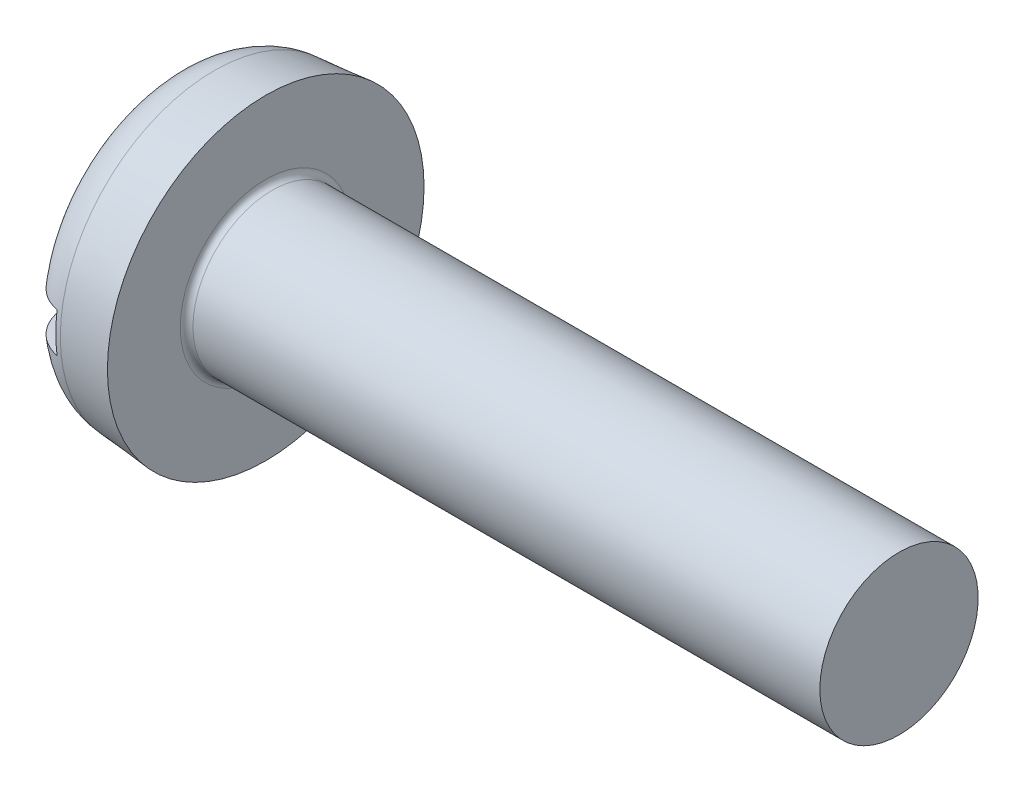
ISO-10303-21;
HEADER;
FILE_DESCRIPTION(('STEP AP214'),'2;1');
FILE_NAME('part.step','',(''),(''),'','','');
FILE_SCHEMA(('AUTOMOTIVE_DESIGN { 1 0 10303 214 1 1 1 1 }'));
ENDSEC;
DATA;
#1=APPLICATION_CONTEXT('core data for automotive mechanical design processes');
#2=APPLICATION_PROTOCOL_DEFINITION('international standard','automotive_design',2000,#1);
#3=PRODUCT_CONTEXT('',#1,'mechanical');
#4=PRODUCT('Part','Part','',(#3));
#5=PRODUCT_RELATED_PRODUCT_CATEGORY('part','',(#4));
#6=PRODUCT_DEFINITION_FORMATION('','',#4);
#7=PRODUCT_DEFINITION_CONTEXT('part definition',#1,'design');
#8=PRODUCT_DEFINITION('design','',#6,#7);
#9=PRODUCT_DEFINITION_SHAPE('','',#8);
#10=(LENGTH_UNIT() NAMED_UNIT(*) SI_UNIT(.MILLI.,.METRE.));
#11=(NAMED_UNIT(*) PLANE_ANGLE_UNIT() SI_UNIT($,.RADIAN.));
#12=(NAMED_UNIT(*) SI_UNIT($,.STERADIAN.) SOLID_ANGLE_UNIT());
#13=UNCERTAINTY_MEASURE_WITH_UNIT(LENGTH_MEASURE(1.E-05),#10,'distance_accuracy_value','');
#14=(GEOMETRIC_REPRESENTATION_CONTEXT(3) GLOBAL_UNCERTAINTY_ASSIGNED_CONTEXT((#13)) GLOBAL_UNIT_ASSIGNED_CONTEXT((#10,
#11,#12)) REPRESENTATION_CONTEXT('',''));
#15=CARTESIAN_POINT('',(0.,0.,0.));
#16=DIRECTION('',(0.,0.,1.));
#17=DIRECTION('',(1.,0.,0.));
#18=AXIS2_PLACEMENT_3D('',#15,#16,#17);
#19=CARTESIAN_POINT('',(0.,0.,0.));
#20=DIRECTION('',(1.,0.,0.));
#21=DIRECTION('',(0.,0.,-1.));
#22=AXIS2_PLACEMENT_3D('',#19,#20,#21);
#23=PLANE('',#22);
#24=CARTESIAN_POINT('',(0.,0.,0.));
#25=DIRECTION('',(1.,0.,0.));
#26=DIRECTION('',(0.,0.,-1.));
#27=AXIS2_PLACEMENT_3D('',#24,#25,#26);
#28=CIRCLE('',#27,6.72607449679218);
#29=CARTESIAN_POINT('',(0.,1.25,6.60890143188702));
#30=VERTEX_POINT('',#29);
#31=CARTESIAN_POINT('',(0.,1.25,-6.60890143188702));
#32=VERTEX_POINT('',#31);
#33=EDGE_CURVE('E100',#30,#32,#28,.F.);
#34=ORIENTED_EDGE('',*,*,#33,.T.);
#35=DIRECTION('',(0.,0.,-1.));
#36=VECTOR('',#35,1.);
#37=CARTESIAN_POINT('',(0.,1.25,-10.));
#38=LINE('',#37,#36);
#39=EDGE_CURVE('E93',#30,#32,#38,.T.);
#40=ORIENTED_EDGE('',*,*,#39,.F.);
#41=EDGE_LOOP('',(#34,#40));
#42=FACE_BOUND('',#41,.T.);
#43=ADVANCED_FACE('F39',(#42),#23,.F.);
#44=CARTESIAN_POINT('',(0.,-1.25,-6.60890143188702));
#45=VERTEX_POINT('',#44);
#46=CARTESIAN_POINT('',(0.,-1.25,6.60890143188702));
#47=VERTEX_POINT('',#46);
#48=EDGE_CURVE('E89',#45,#47,#28,.F.);
#49=ORIENTED_EDGE('',*,*,#48,.T.);
#50=DIRECTION('',(0.,0.,1.));
#51=VECTOR('',#50,1.);
#52=CARTESIAN_POINT('',(0.,-1.25,-10.));
#53=LINE('',#52,#51);
#54=EDGE_CURVE('E81',#45,#47,#53,.T.);
#55=ORIENTED_EDGE('',*,*,#54,.F.);
#56=EDGE_LOOP('',(#49,#55));
#57=FACE_BOUND('',#56,.T.);
#58=ADVANCED_FACE('F87',(#57),#23,.F.);
#59=CARTESIAN_POINT('',(6.,0.,0.));
#60=DIRECTION('',(1.,0.,0.));
#61=DIRECTION('',(0.,0.,-1.));
#62=AXIS2_PLACEMENT_3D('',#59,#60,#61);
#63=CONICAL_SURFACE('',#62,10.,0.0872664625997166);
#64=CARTESIAN_POINT('',(2.73853277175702,0.,0.));
#65=DIRECTION('',(-1.,0.,0.));
#66=DIRECTION('',(0.,0.,1.));
#67=AXIS2_PLACEMENT_3D('',#64,#65,#66);
#68=CIRCLE('',#67,9.71465859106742);
#69=CARTESIAN_POINT('',(2.73853277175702,0.,9.71465859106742));
#70=VERTEX_POINT('',#69);
#71=EDGE_CURVE('E96',#70,#70,#68,.F.);
#72=ORIENTED_EDGE('',*,*,#71,.T.);
#73=EDGE_LOOP('',(#72));
#74=FACE_BOUND('',#73,.T.);
#75=CARTESIAN_POINT('',(6.,0.,0.));
#76=DIRECTION('',(-1.,0.,0.));
#77=DIRECTION('',(0.,0.,1.));
#78=AXIS2_PLACEMENT_3D('',#75,#76,#77);
#79=CIRCLE('',#78,10.);
#80=CARTESIAN_POINT('',(6.,0.,10.));
#81=VERTEX_POINT('',#80);
#82=EDGE_CURVE('E102',#81,#81,#79,.T.);
#83=ORIENTED_EDGE('',*,*,#82,.T.);
#84=EDGE_LOOP('',(#83));
#85=FACE_BOUND('',#84,.T.);
#86=ADVANCED_FACE('F149',(#74,#85),#63,.T.);
#87=CARTESIAN_POINT('',(6.,10.,0.));
#88=DIRECTION('',(-1.,0.,0.));
#89=DIRECTION('',(0.,0.,1.));
#90=AXIS2_PLACEMENT_3D('',#87,#88,#89);
#91=PLANE('',#90);
#92=CARTESIAN_POINT('',(6.,0.,0.));
#93=DIRECTION('',(-1.,0.,0.));
#94=DIRECTION('',(0.,0.,1.));
#95=AXIS2_PLACEMENT_3D('',#92,#93,#94);
#96=CIRCLE('',#95,5.4);
#97=CARTESIAN_POINT('',(6.,0.,5.4));
#98=VERTEX_POINT('',#97);
#99=EDGE_CURVE('E105',#98,#98,#96,.T.);
#100=ORIENTED_EDGE('',*,*,#99,.T.);
#101=EDGE_LOOP('',(#100));
#102=FACE_BOUND('',#101,.T.);
#103=ORIENTED_EDGE('',*,*,#82,.F.);
#104=EDGE_LOOP('',(#103));
#105=FACE_BOUND('',#104,.T.);
#106=ADVANCED_FACE('F143',(#102,#105),#91,.F.);
#107=CARTESIAN_POINT('',(0.,0.,0.));
#108=DIRECTION('',(-1.,0.,0.));
#109=DIRECTION('',(0.,0.,1.));
#110=AXIS2_PLACEMENT_3D('',#107,#108,#109);
#111=CYLINDRICAL_SURFACE('',#110,5.);
#112=CARTESIAN_POINT('',(6.4,0.,0.));
#113=DIRECTION('',(-1.,0.,0.));
#114=DIRECTION('',(0.,0.,1.));
#115=AXIS2_PLACEMENT_3D('',#112,#113,#114);
#116=CIRCLE('',#115,5.);
#117=CARTESIAN_POINT('',(6.4,0.,5.));
#118=VERTEX_POINT('',#117);
#119=EDGE_CURVE('E111',#118,#118,#116,.F.);
#120=ORIENTED_EDGE('',*,*,#119,.T.);
#121=EDGE_LOOP('',(#120));
#122=FACE_BOUND('',#121,.T.);
#123=CARTESIAN_POINT('',(46.,0.,0.));
#124=DIRECTION('',(-1.,0.,0.));
#125=DIRECTION('',(0.,0.,1.));
#126=AXIS2_PLACEMENT_3D('',#123,#124,#125);
#127=CIRCLE('',#126,5.);
#128=CARTESIAN_POINT('',(46.,0.,5.));
#129=VERTEX_POINT('',#128);
#130=EDGE_CURVE('E166',#129,#129,#127,.T.);
#131=ORIENTED_EDGE('',*,*,#130,.T.);
#132=EDGE_LOOP('',(#131));
#133=FACE_BOUND('',#132,.T.);
#134=ADVANCED_FACE('F142',(#122,#133),#111,.T.);
#135=CARTESIAN_POINT('',(46.,5.,0.));
#136=DIRECTION('',(-1.,0.,0.));
#137=DIRECTION('',(0.,0.,1.));
#138=AXIS2_PLACEMENT_3D('',#135,#136,#137);
#139=PLANE('',#138);
#140=ORIENTED_EDGE('',*,*,#130,.F.);
#141=EDGE_LOOP('',(#140));
#142=FACE_BOUND('',#141,.T.);
#143=ADVANCED_FACE('F132',(#142),#139,.F.);
#144=CARTESIAN_POINT('',(3.,0.,0.));
#145=DIRECTION('',(1.,0.,0.));
#146=DIRECTION('',(0.,0.,-1.));
#147=AXIS2_PLACEMENT_3D('',#144,#145,#146);
#148=TOROIDAL_SURFACE('',#147,6.72607449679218,3.);
#149=CARTESIAN_POINT('',(1.34081251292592,1.25,-9.14041771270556));
#150=CARTESIAN_POINT('',(1.47997004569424,1.25,-9.23364559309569));
#151=CARTESIAN_POINT('',(1.62706942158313,1.25,-9.31523086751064));
#152=CARTESIAN_POINT('',(1.93299124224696,1.25,-9.45262888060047));
#153=CARTESIAN_POINT('',(2.09182681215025,1.25,-9.50841224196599));
#154=CARTESIAN_POINT('',(2.41658159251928,1.25,-9.59246600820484));
#155=CARTESIAN_POINT('',(2.582498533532,1.25,-9.62074515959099));
#156=CARTESIAN_POINT('',(2.91668270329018,1.25,-9.64897084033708));
#157=CARTESIAN_POINT('',(3.08494936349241,1.25,-9.64892410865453));
#158=CARTESIAN_POINT('',(3.41873792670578,1.25,-9.6205489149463));
#159=CARTESIAN_POINT('',(3.58426467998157,1.25,-9.59227747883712));
#160=CARTESIAN_POINT('',(3.9082324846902,1.25,-9.50836629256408));
#161=CARTESIAN_POINT('',(4.06667331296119,1.25,-9.45272568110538));
#162=CARTESIAN_POINT('',(4.37212351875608,1.25,-9.31564696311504));
#163=CARTESIAN_POINT('',(4.51912348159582,1.25,-9.23418788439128));
#164=CARTESIAN_POINT('',(4.79744436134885,1.25,-9.04785785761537));
#165=CARTESIAN_POINT('',(4.92876507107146,1.25,-8.94298660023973));
#166=CARTESIAN_POINT('',(5.17270515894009,1.25,-8.71230286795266));
#167=CARTESIAN_POINT('',(5.28523171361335,1.25,-8.5863922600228));
#168=CARTESIAN_POINT('',(5.48776799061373,1.25,-8.3176111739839));
#169=CARTESIAN_POINT('',(5.57777697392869,1.25,-8.17474013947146));
#170=CARTESIAN_POINT('',(5.73362485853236,1.25,-7.87474584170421));
#171=CARTESIAN_POINT('',(5.79923985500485,1.25,-7.71750629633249));
#172=CARTESIAN_POINT('',(5.90351740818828,1.25,-7.39433678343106));
#173=CARTESIAN_POINT('',(5.94217838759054,1.25,-7.22840630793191));
#174=CARTESIAN_POINT('',(5.99202504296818,1.25,-6.89024711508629));
#175=CARTESIAN_POINT('',(6.0028436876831,1.25,-6.71796433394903));
#176=CARTESIAN_POINT('',(5.99588219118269,1.25,-6.37398151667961));
#177=CARTESIAN_POINT('',(5.97809968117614,1.25,-6.20228152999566));
#178=CARTESIAN_POINT('',(5.91412563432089,1.25,-5.86143261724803));
#179=CARTESIAN_POINT('',(5.86748736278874,1.25,-5.69236752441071));
#180=CARTESIAN_POINT('',(5.74686216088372,1.25,-5.36428557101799));
#181=CARTESIAN_POINT('',(5.67287236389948,1.25,-5.20526976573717));
#182=CARTESIAN_POINT('',(5.49848893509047,1.25,-4.89968131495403));
#183=CARTESIAN_POINT('',(5.3977652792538,1.25,-4.75329681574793));
#184=CARTESIAN_POINT('',(5.17308325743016,1.25,-4.47955663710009));
#185=CARTESIAN_POINT('',(5.04912274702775,1.25,-4.35220271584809));
#186=CARTESIAN_POINT('',(4.78177797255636,1.25,-4.12101899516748));
#187=CARTESIAN_POINT('',(4.63847541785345,1.25,-4.0170949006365));
#188=CARTESIAN_POINT('',(4.33591165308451,1.25,-3.83586047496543));
#189=CARTESIAN_POINT('',(4.17665481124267,1.25,-3.75854288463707));
#190=CARTESIAN_POINT('',(3.85300941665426,1.25,-3.63615461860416));
#191=CARTESIAN_POINT('',(3.68903889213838,1.25,-3.5899808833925));
#192=CARTESIAN_POINT('',(3.35552430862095,1.25,-3.52750009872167));
#193=CARTESIAN_POINT('',(3.18598268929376,1.25,-3.5111801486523));
#194=CARTESIAN_POINT('',(2.8554004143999,1.25,-3.5092586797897));
#195=CARTESIAN_POINT('',(2.69436660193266,1.25,-3.52213490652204));
#196=CARTESIAN_POINT('',(2.37679746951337,1.25,-3.57489222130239));
#197=CARTESIAN_POINT('',(2.22026226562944,1.25,-3.61477400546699));
#198=CARTESIAN_POINT('',(1.91661079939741,1.25,-3.71960592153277));
#199=CARTESIAN_POINT('',(1.76945756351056,1.25,-3.78444951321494));
#200=CARTESIAN_POINT('',(1.48742680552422,1.25,-3.93683229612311));
#201=CARTESIAN_POINT('',(1.35255176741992,1.25,-4.02437606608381));
#202=CARTESIAN_POINT('',(1.09216492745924,1.25,-4.22401407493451));
#203=CARTESIAN_POINT('',(0.967387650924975,1.25,-4.33706621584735));
#204=CARTESIAN_POINT('',(0.737585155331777,1.25,-4.58172455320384));
#205=CARTESIAN_POINT('',(0.632564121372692,1.25,-4.71333467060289));
#206=CARTESIAN_POINT('',(0.440706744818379,1.25,-4.99764835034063));
#207=CARTESIAN_POINT('',(0.354858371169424,1.25,-5.15101980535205));
#208=CARTESIAN_POINT('',(0.20975973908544,1.25,-5.46987555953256));
#209=CARTESIAN_POINT('',(0.15051185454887,1.25,-5.63536093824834));
#210=CARTESIAN_POINT('',(0.0598248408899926,1.25,-5.97596403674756));
#211=CARTESIAN_POINT('',(0.0287331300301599,1.25,-6.15117451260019));
#212=CARTESIAN_POINT('',(-0.0032799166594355,1.25,-6.50433093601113));
#213=CARTESIAN_POINT('',(-0.00420344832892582,1.25,-6.68227668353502));
#214=CARTESIAN_POINT('',(0.0242494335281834,1.25,-7.03395549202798));
#215=CARTESIAN_POINT('',(0.0533248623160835,1.25,-7.20771284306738));
#216=CARTESIAN_POINT('',(0.140732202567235,1.25,-7.54776258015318));
#217=CARTESIAN_POINT('',(0.199069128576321,1.25,-7.7140536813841));
#218=CARTESIAN_POINT('',(0.342342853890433,1.25,-8.03161087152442));
#219=CARTESIAN_POINT('',(0.426850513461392,1.25,-8.18307087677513));
#220=CARTESIAN_POINT('',(0.620392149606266,1.25,-8.46922964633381));
#221=CARTESIAN_POINT('',(0.729393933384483,1.25,-8.60395005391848));
#222=CARTESIAN_POINT('',(0.923342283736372,1.25,-8.80549358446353));
#223=CARTESIAN_POINT('',(1.00176332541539,1.25,-8.87870697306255));
#224=CARTESIAN_POINT('',(1.16597654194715,1.25,-9.01634176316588));
#225=CARTESIAN_POINT('',(1.25176865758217,1.25,-9.08076323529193));
#226=CARTESIAN_POINT('',(1.34081251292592,1.25,-9.14041771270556));
#227=B_SPLINE_CURVE_WITH_KNOTS('',3,(#149,#150,#151,#152,#153,#154,#155,#156,#157,#158,#159,
#160,#161,#162,#163,#164,#165,#166,#167,#168,#169,#170,#171,#172,#173,#174,#175,#176,#177,#178,
#179,#180,#181,#182,#183,#184,#185,#186,#187,#188,#189,#190,#191,#192,#193,#194,#195,#196,#197,
#198,#199,#200,#201,#202,#203,#204,#205,#206,#207,#208,#209,#210,#211,#212,#213,#214,#215,#216,
#217,#218,#219,#220,#221,#222,#223,#224,#225,#226),.UNSPECIFIED.,.T.,.F.,(4,2,2,2,2,2,2,2,2,2,2,
2,2,2,2,2,2,2,2,2,2,2,2,2,2,2,2,2,2,2,2,2,2,2,2,2,2,2,4),(0.,0.502110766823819,1.00479182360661,
1.50731297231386,2.00971456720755,2.51110314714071,3.012507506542,3.51432020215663,
4.01613952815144,4.52036837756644,5.02461377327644,5.53337945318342,6.04217490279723,
6.55764396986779,7.07315573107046,7.59685536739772,8.1206099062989,8.65115781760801,
9.18175471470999,9.71017647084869,10.238453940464,10.7468704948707,11.2550672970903,
11.7373799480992,12.2197050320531,12.6999939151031,13.1803797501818,13.6832676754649,
14.1862620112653,14.7111036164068,15.2359920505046,15.7672721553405,16.2985135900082,
16.8244763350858,17.3505292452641,17.8683760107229,18.3855461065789,18.706838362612,
19.0281280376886),.UNSPECIFIED.);
#228=CARTESIAN_POINT('',(2.4,1.25,-9.58429232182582));
#229=VERTEX_POINT('',#228);
#230=EDGE_CURVE('E11',#32,#229,#227,.T.);
#231=ORIENTED_EDGE('',*,*,#230,.F.);
#232=ORIENTED_EDGE('',*,*,#33,.F.);
#233=CARTESIAN_POINT('',(1.26382191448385,1.25,4.09288311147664));
#234=CARTESIAN_POINT('',(1.39631174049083,1.25,3.99458178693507));
#235=CARTESIAN_POINT('',(1.53683479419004,1.25,3.90696138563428));
#236=CARTESIAN_POINT('',(1.83053177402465,1.25,3.75610676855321));
#237=CARTESIAN_POINT('',(1.98371360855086,1.25,3.69288793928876));
#238=CARTESIAN_POINT('',(2.29892040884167,1.25,3.59332982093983));
#239=CARTESIAN_POINT('',(2.46096015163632,1.25,3.55703701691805));
#240=CARTESIAN_POINT('',(2.78884813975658,1.25,3.51321694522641));
#241=CARTESIAN_POINT('',(2.95469492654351,1.25,3.50567884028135));
#242=CARTESIAN_POINT('',(3.27994031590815,1.25,3.51948431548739));
#243=CARTESIAN_POINT('',(3.4393779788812,1.25,3.53992920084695));
#244=CARTESIAN_POINT('',(3.7525839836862,1.25,3.60718385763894));
#245=CARTESIAN_POINT('',(3.90635165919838,1.25,3.65399671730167));
#246=CARTESIAN_POINT('',(4.20491167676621,1.25,3.77236774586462));
#247=CARTESIAN_POINT('',(4.34965447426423,1.25,3.84405037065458));
#248=CARTESIAN_POINT('',(4.62584761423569,1.25,4.00957310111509));
#249=CARTESIAN_POINT('',(4.75729521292,1.25,4.10341776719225));
#250=CARTESIAN_POINT('',(5.01008641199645,1.25,4.31560294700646));
#251=CARTESIAN_POINT('',(5.13060261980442,1.25,4.43492945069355));
#252=CARTESIAN_POINT('',(5.35084651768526,1.25,4.6914352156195));
#253=CARTESIAN_POINT('',(5.45057006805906,1.25,4.82861802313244));
#254=CARTESIAN_POINT('',(5.63028092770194,1.25,5.12291936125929));
#255=CARTESIAN_POINT('',(5.70932861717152,1.25,5.28061277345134));
#256=CARTESIAN_POINT('',(5.84008253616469,1.25,5.60696299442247));
#257=CARTESIAN_POINT('',(5.89178690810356,1.25,5.77562054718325));
#258=CARTESIAN_POINT('',(5.96656074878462,1.25,6.12062107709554));
#259=CARTESIAN_POINT('',(5.98939433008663,1.25,6.2970153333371));
#260=CARTESIAN_POINT('',(6.00475651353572,1.25,6.65112545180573));
#261=CARTESIAN_POINT('',(5.99728647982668,1.25,6.82884125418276));
#262=CARTESIAN_POINT('',(5.95226956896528,1.25,7.17835050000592));
#263=CARTESIAN_POINT('',(5.9150694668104,1.25,7.35018854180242));
#264=CARTESIAN_POINT('',(5.81186963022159,1.25,7.68499211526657));
#265=CARTESIAN_POINT('',(5.74587228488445,1.25,7.84795838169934));
#266=CARTESIAN_POINT('',(5.58811425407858,1.25,8.15759311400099));
#267=CARTESIAN_POINT('',(5.49678615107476,1.25,8.30448200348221));
#268=CARTESIAN_POINT('',(5.29044367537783,1.25,8.58055953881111));
#269=CARTESIAN_POINT('',(5.17543111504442,1.25,8.70974953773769));
#270=CARTESIAN_POINT('',(4.92670266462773,1.25,8.94491272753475));
#271=CARTESIAN_POINT('',(4.79326400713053,1.25,9.05117920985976));
#272=CARTESIAN_POINT('',(4.51029957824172,1.25,9.23954806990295));
#273=CARTESIAN_POINT('',(4.36077469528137,1.25,9.32165178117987));
#274=CARTESIAN_POINT('',(4.05140347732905,1.25,9.45858963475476));
#275=CARTESIAN_POINT('',(3.89166723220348,1.25,9.51367257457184));
#276=CARTESIAN_POINT('',(3.5651895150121,1.25,9.59608516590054));
#277=CARTESIAN_POINT('',(3.39844827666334,1.25,9.62341574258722));
#278=CARTESIAN_POINT('',(3.06360210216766,1.25,9.64944728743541));
#279=CARTESIAN_POINT('',(2.89550841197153,1.25,9.64829313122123));
#280=CARTESIAN_POINT('',(2.56190846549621,1.25,9.61774706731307));
#281=CARTESIAN_POINT('',(2.39640217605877,1.25,9.5883555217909));
#282=CARTESIAN_POINT('',(2.07284859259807,1.25,9.50224487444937));
#283=CARTESIAN_POINT('',(1.91479362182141,1.25,9.44555460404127));
#284=CARTESIAN_POINT('',(1.61040732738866,1.25,9.30651671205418));
#285=CARTESIAN_POINT('',(1.46407606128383,1.25,9.2241689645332));
#286=CARTESIAN_POINT('',(1.18681533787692,1.25,9.03593655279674));
#287=CARTESIAN_POINT('',(1.05593137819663,1.25,8.92998488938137));
#288=CARTESIAN_POINT('',(0.813660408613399,1.25,8.69774897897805));
#289=CARTESIAN_POINT('',(0.702273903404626,1.25,8.57146420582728));
#290=CARTESIAN_POINT('',(0.501297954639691,1.25,8.30123763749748));
#291=CARTESIAN_POINT('',(0.411865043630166,1.25,8.15717945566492));
#292=CARTESIAN_POINT('',(0.258151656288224,1.25,7.85622272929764));
#293=CARTESIAN_POINT('',(0.193872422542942,1.25,7.69932355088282));
#294=CARTESIAN_POINT('',(0.0914844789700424,1.25,7.3752775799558));
#295=CARTESIAN_POINT('',(0.0536765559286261,1.25,7.208035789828));
#296=CARTESIAN_POINT('',(0.00623193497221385,1.25,6.86961495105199));
#297=CARTESIAN_POINT('',(-0.00340386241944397,1.25,6.69843577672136));
#298=CARTESIAN_POINT('',(0.0055952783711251,1.25,6.354288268));
#299=CARTESIAN_POINT('',(0.024650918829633,1.25,6.18133097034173));
#300=CARTESIAN_POINT('',(0.0910744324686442,1.25,5.84089682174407));
#301=CARTESIAN_POINT('',(0.138451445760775,1.25,5.67342175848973));
#302=CARTESIAN_POINT('',(0.261041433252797,1.25,5.34594500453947));
#303=CARTESIAN_POINT('',(0.336686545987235,1.25,5.18610522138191));
#304=CARTESIAN_POINT('',(0.513520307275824,1.25,4.88138088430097));
#305=CARTESIAN_POINT('',(0.614684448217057,1.25,4.7364821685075));
#306=CARTESIAN_POINT('',(0.806158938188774,1.25,4.50617052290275));
#307=CARTESIAN_POINT('',(0.890708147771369,1.25,4.41590482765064));
#308=CARTESIAN_POINT('',(1.06994471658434,1.25,4.24605829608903));
#309=CARTESIAN_POINT('',(1.16463203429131,1.25,4.16647741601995));
#310=CARTESIAN_POINT('',(1.26382191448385,1.25,4.09288311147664));
#311=B_SPLINE_CURVE_WITH_KNOTS('',3,(#233,#234,#235,#236,#237,#238,#239,#240,#241,#242,#243,
#244,#245,#246,#247,#248,#249,#250,#251,#252,#253,#254,#255,#256,#257,#258,#259,#260,#261,#262,
#263,#264,#265,#266,#267,#268,#269,#270,#271,#272,#273,#274,#275,#276,#277,#278,#279,#280,#281,
#282,#283,#284,#285,#286,#287,#288,#289,#290,#291,#292,#293,#294,#295,#296,#297,#298,#299,#300,
#301,#302,#303,#304,#305,#306,#307,#308,#309,#310),.UNSPECIFIED.,.T.,.F.,(4,2,2,2,2,2,2,2,2,2,2,
2,2,2,2,2,2,2,2,2,2,2,2,2,2,2,2,2,2,2,2,2,2,2,2,2,2,2,4),(0.,0.494505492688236,
0.989322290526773,1.48499136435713,1.98047360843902,2.46041092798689,2.94040446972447,
3.42283554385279,3.9053659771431,4.41188934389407,4.91851346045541,5.44523072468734,
5.97198376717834,6.50301338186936,7.03401909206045,7.55891993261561,8.08377723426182,
8.60017143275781,9.11652613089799,9.62582070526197,10.1350871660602,10.6395720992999,
11.1440402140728,11.6459430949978,12.1478395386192,12.649207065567,13.1505770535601,
13.6533887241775,14.1562134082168,14.6625254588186,15.1688625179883,15.6808634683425,
16.1928807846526,16.7124792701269,17.2322455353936,17.7603061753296,18.2878616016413,
18.6580797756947,19.0282964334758),.UNSPECIFIED.);
#312=CARTESIAN_POINT('',(2.4,1.25,9.58429232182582));
#313=VERTEX_POINT('',#312);
#314=EDGE_CURVE('E122',#313,#30,#311,.T.);
#315=ORIENTED_EDGE('',*,*,#314,.F.);
#316=CARTESIAN_POINT('',(2.4,0.,0.));
#317=DIRECTION('',(-1.,0.,0.));
#318=DIRECTION('',(0.,0.,1.));
#319=AXIS2_PLACEMENT_3D('',#316,#317,#318);
#320=CIRCLE('',#319,9.665462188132);
#321=CARTESIAN_POINT('',(2.4,-1.25,9.58429232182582));
#322=VERTEX_POINT('',#321);
#323=EDGE_CURVE('E112',#313,#322,#320,.F.);
#324=ORIENTED_EDGE('',*,*,#323,.T.);
#325=CARTESIAN_POINT('',(1.26382191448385,-1.25,4.09288311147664));
#326=CARTESIAN_POINT('',(1.12281074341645,-1.25,4.19752142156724));
#327=CARTESIAN_POINT('',(0.990698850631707,-1.25,4.31441743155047));
#328=CARTESIAN_POINT('',(0.74787010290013,-1.25,4.56888367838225));
#329=CARTESIAN_POINT('',(0.637190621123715,-1.25,4.70648929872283));
#330=CARTESIAN_POINT('',(0.440429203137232,-1.25,4.9980490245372));
#331=CARTESIAN_POINT('',(0.354316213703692,-1.25,5.15198215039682));
#332=CARTESIAN_POINT('',(0.208917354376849,-1.25,5.47195794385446));
#333=CARTESIAN_POINT('',(0.14962093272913,-1.25,5.63799581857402));
#334=CARTESIAN_POINT('',(0.0591591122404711,-1.25,5.97919547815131));
#335=CARTESIAN_POINT('',(0.0282535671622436,-1.25,6.15442632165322));
#336=CARTESIAN_POINT('',(-0.00338918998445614,-1.25,6.50761279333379));
#337=CARTESIAN_POINT('',(-0.00412508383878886,-1.25,6.68556854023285));
#338=CARTESIAN_POINT('',(0.0247048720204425,-1.25,7.03724099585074));
#339=CARTESIAN_POINT('',(0.0539706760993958,-1.25,7.21098223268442));
#340=CARTESIAN_POINT('',(0.141741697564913,-1.25,7.55091873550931));
#341=CARTESIAN_POINT('',(0.200244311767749,-1.25,7.71711467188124));
#342=CARTESIAN_POINT('',(0.343804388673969,-1.25,8.03439272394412));
#343=CARTESIAN_POINT('',(0.428419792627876,-1.25,8.18567487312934));
#344=CARTESIAN_POINT('',(0.622195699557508,-1.25,8.47160793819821));
#345=CARTESIAN_POINT('',(0.731354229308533,-1.25,8.60626018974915));
#346=CARTESIAN_POINT('',(0.96942477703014,-1.25,8.85310619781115));
#347=CARTESIAN_POINT('',(1.09803469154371,-1.25,8.96559138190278));
#348=CARTESIAN_POINT('',(1.37247594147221,-1.25,9.1671108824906));
#349=CARTESIAN_POINT('',(1.51830629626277,-1.25,9.25614653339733));
#350=CARTESIAN_POINT('',(1.82146880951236,-1.25,9.40733759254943));
#351=CARTESIAN_POINT('',(1.97867156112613,-1.25,9.46975256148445));
#352=CARTESIAN_POINT('',(2.30135991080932,-1.25,9.56713490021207));
#353=CARTESIAN_POINT('',(2.4668452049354,-1.25,9.60210327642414));
#354=CARTESIAN_POINT('',(2.80039759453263,-1.25,9.64343725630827));
#355=CARTESIAN_POINT('',(2.96844482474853,-1.25,9.64996332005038));
#356=CARTESIAN_POINT('',(3.30324155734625,-1.25,9.6346603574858));
#357=CARTESIAN_POINT('',(3.46999107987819,-1.25,9.61283177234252));
#358=CARTESIAN_POINT('',(3.79718728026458,-1.25,9.54151976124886));
#359=CARTESIAN_POINT('',(3.95764354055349,-1.25,9.49208027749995));
#360=CARTESIAN_POINT('',(4.26800546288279,-1.25,9.36702530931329));
#361=CARTESIAN_POINT('',(4.4179110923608,-1.25,9.29140974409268));
#362=CARTESIAN_POINT('',(4.70331583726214,-1.25,9.11599680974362));
#363=CARTESIAN_POINT('',(4.83878039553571,-1.25,9.01614322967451));
#364=CARTESIAN_POINT('',(5.09115301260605,-1.25,8.79524289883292));
#365=CARTESIAN_POINT('',(5.20806065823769,-1.25,8.67419567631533));
#366=CARTESIAN_POINT('',(5.42083261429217,-1.25,8.41354747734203));
#367=CARTESIAN_POINT('',(5.51655799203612,-1.25,8.27383311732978));
#368=CARTESIAN_POINT('',(5.68347418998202,-1.25,7.98045265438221));
#369=CARTESIAN_POINT('',(5.75466396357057,-1.25,7.82678595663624));
#370=CARTESIAN_POINT('',(5.87133394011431,-1.25,7.50813812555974));
#371=CARTESIAN_POINT('',(5.91653366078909,-1.25,7.3430543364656));
#372=CARTESIAN_POINT('',(5.97900569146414,-1.25,7.00769021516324));
#373=CARTESIAN_POINT('',(5.99627609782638,-1.25,6.83740952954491));
#374=CARTESIAN_POINT('',(6.00268828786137,-1.25,6.49385300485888));
#375=CARTESIAN_POINT('',(5.99141884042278,-1.25,6.32056951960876));
#376=CARTESIAN_POINT('',(5.9404210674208,-1.25,5.97824398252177));
#377=CARTESIAN_POINT('',(5.90069018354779,-1.25,5.80920231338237));
#378=CARTESIAN_POINT('',(5.79317703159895,-1.25,5.47732529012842));
#379=CARTESIAN_POINT('',(5.72496109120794,-1.25,5.31463035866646));
#380=CARTESIAN_POINT('',(5.56242137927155,-1.25,5.00283223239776));
#381=CARTESIAN_POINT('',(5.46809456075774,-1.25,4.85373062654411));
#382=CARTESIAN_POINT('',(5.25495485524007,-1.25,4.57213876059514));
#383=CARTESIAN_POINT('',(5.13593814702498,-1.25,4.43980256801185));
#384=CARTESIAN_POINT('',(4.87705851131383,-1.25,4.19733582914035));
#385=CARTESIAN_POINT('',(4.73719542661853,-1.25,4.08720545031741));
#386=CARTESIAN_POINT('',(4.44272329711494,-1.25,3.89454641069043));
#387=CARTESIAN_POINT('',(4.28838268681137,-1.25,3.81160846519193));
#388=CARTESIAN_POINT('',(3.96747535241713,-1.25,3.67434892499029));
#389=CARTESIAN_POINT('',(3.80091453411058,-1.25,3.62001360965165));
#390=CARTESIAN_POINT('',(3.46897458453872,-1.25,3.54439614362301));
#391=CARTESIAN_POINT('',(3.30393261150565,-1.25,3.52163376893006));
#392=CARTESIAN_POINT('',(2.9723850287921,-1.25,3.50541724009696));
#393=CARTESIAN_POINT('',(2.80587941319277,-1.25,3.51196320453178));
#394=CARTESIAN_POINT('',(2.48303155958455,-1.25,3.55319863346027));
#395=CARTESIAN_POINT('',(2.32654576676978,-1.25,3.5867850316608));
#396=CARTESIAN_POINT('',(2.02138294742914,-1.25,3.6792339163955));
#397=CARTESIAN_POINT('',(1.87269750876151,-1.25,3.73806851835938));
#398=CARTESIAN_POINT('',(1.64800101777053,-1.25,3.84858253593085));
#399=CARTESIAN_POINT('',(1.56810163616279,-1.25,3.89256303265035));
#400=CARTESIAN_POINT('',(1.41260969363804,-1.25,3.98755607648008));
#401=CARTESIAN_POINT('',(1.33701691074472,-1.25,4.03856826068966));
#402=CARTESIAN_POINT('',(1.26382191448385,-1.25,4.09288311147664));
#403=B_SPLINE_CURVE_WITH_KNOTS('',3,(#325,#326,#327,#328,#329,#330,#331,#332,#333,#334,#335,
#336,#337,#338,#339,#340,#341,#342,#343,#344,#345,#346,#347,#348,#349,#350,#351,#352,#353,#354,
#355,#356,#357,#358,#359,#360,#361,#362,#363,#364,#365,#366,#367,#368,#369,#370,#371,#372,#373,
#374,#375,#376,#377,#378,#379,#380,#381,#382,#383,#384,#385,#386,#387,#388,#389,#390,#391,#392,
#393,#394,#395,#396,#397,#398,#399,#400,#401,#402),.UNSPECIFIED.,.T.,.F.,(4,2,2,2,2,2,2,2,2,2,2,
2,2,2,2,2,2,2,2,2,2,2,2,2,2,2,2,2,2,2,2,2,2,2,2,2,2,2,4),(0.,0.526440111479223,1.0537901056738,
1.58047052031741,2.10694351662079,2.63818851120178,3.1694567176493,3.69546307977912,
4.22142261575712,4.73892601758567,5.25638782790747,5.76651089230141,6.27660492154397,
6.78160488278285,7.28658632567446,7.78871514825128,8.29083615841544,8.79216032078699,
9.29348603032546,9.79598567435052,10.2984965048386,10.8042115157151,11.3099480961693,
11.8210447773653,12.3321762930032,12.8507144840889,13.369299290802,13.8960850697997,
14.4229323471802,14.95431552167,15.4857027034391,16.0086791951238,16.5314045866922,
17.0286845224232,17.5259664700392,18.0039322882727,18.4813715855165,18.7546461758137,
19.0279066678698),.UNSPECIFIED.);
#404=EDGE_CURVE('E97',#47,#322,#403,.T.);
#405=ORIENTED_EDGE('',*,*,#404,.F.);
#406=ORIENTED_EDGE('',*,*,#48,.F.);
#407=CARTESIAN_POINT('',(1.34081251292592,-1.25,-9.14041771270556));
#408=CARTESIAN_POINT('',(1.20015060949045,-1.25,-9.04616345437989));
#409=CARTESIAN_POINT('',(1.06739622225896,-1.25,-8.93987123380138));
#410=CARTESIAN_POINT('',(0.821572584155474,-1.25,-8.70635450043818));
#411=CARTESIAN_POINT('',(0.708529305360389,-1.25,-8.57910279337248));
#412=CARTESIAN_POINT('',(0.505461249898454,-1.25,-8.30757102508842));
#413=CARTESIAN_POINT('',(0.41541519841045,-1.25,-8.16330688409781));
#414=CARTESIAN_POINT('',(0.260623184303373,-1.25,-7.86185378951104));
#415=CARTESIAN_POINT('',(0.195870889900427,-1.25,-7.70466808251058));
#416=CARTESIAN_POINT('',(0.0928000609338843,-1.25,-7.38039972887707));
#417=CARTESIAN_POINT('',(0.0547091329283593,-1.25,-7.21324477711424));
#418=CARTESIAN_POINT('',(0.00668481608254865,-1.25,-6.87493612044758));
#419=CARTESIAN_POINT('',(-0.00324544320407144,-1.25,-6.70378197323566));
#420=CARTESIAN_POINT('',(0.00516243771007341,-1.25,-6.3596214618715));
#421=CARTESIAN_POINT('',(0.0239236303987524,-1.25,-6.18662545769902));
#422=CARTESIAN_POINT('',(0.0897609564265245,-1.25,-5.84610874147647));
#423=CARTESIAN_POINT('',(0.136839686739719,-1.25,-5.67858853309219));
#424=CARTESIAN_POINT('',(0.258821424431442,-1.25,-5.35102736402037));
#425=CARTESIAN_POINT('',(0.334145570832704,-1.25,-5.19114314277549));
#426=CARTESIAN_POINT('',(0.510387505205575,-1.25,-4.88614144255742));
#427=CARTESIAN_POINT('',(0.611308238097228,-1.25,-4.74102566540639));
#428=CARTESIAN_POINT('',(0.836792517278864,-1.25,-4.46885245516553));
#429=CARTESIAN_POINT('',(0.961506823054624,-1.25,-4.34191973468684));
#430=CARTESIAN_POINT('',(1.23086269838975,-1.25,-4.11127536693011));
#431=CARTESIAN_POINT('',(1.37550342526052,-1.25,-4.00756273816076));
#432=CARTESIAN_POINT('',(1.67768102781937,-1.25,-3.82897472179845));
#433=CARTESIAN_POINT('',(1.8348959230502,-1.25,-3.75355591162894));
#434=CARTESIAN_POINT('',(2.1602029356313,-1.25,-3.6318131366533));
#435=CARTESIAN_POINT('',(2.32828995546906,-1.25,-3.58547564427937));
#436=CARTESIAN_POINT('',(2.66136883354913,-1.25,-3.52569372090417));
#437=CARTESIAN_POINT('',(2.82608186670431,-1.25,-3.51069330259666));
#438=CARTESIAN_POINT('',(3.15558374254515,-1.25,-3.50963020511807));
#439=CARTESIAN_POINT('',(3.32037256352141,-1.25,-3.52356174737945));
#440=CARTESIAN_POINT('',(3.6396254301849,-1.25,-3.5787287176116));
#441=CARTESIAN_POINT('',(3.79425061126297,-1.25,-3.61904183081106));
#442=CARTESIAN_POINT('',(4.09483474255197,-1.25,-3.72436563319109));
#443=CARTESIAN_POINT('',(4.24079234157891,-1.25,-3.78938016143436));
#444=CARTESIAN_POINT('',(4.52432841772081,-1.25,-3.9438493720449));
#445=CARTESIAN_POINT('',(4.6615685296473,-1.25,-4.0339238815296));
#446=CARTESIAN_POINT('',(4.91996185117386,-1.25,-4.23475967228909));
#447=CARTESIAN_POINT('',(5.04111149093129,-1.25,-4.34552553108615));
#448=CARTESIAN_POINT('',(5.27035667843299,-1.25,-4.59082905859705));
#449=CARTESIAN_POINT('',(5.37745666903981,-1.25,-4.72629814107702));
#450=CARTESIAN_POINT('',(5.56814264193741,-1.25,-5.01288886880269));
#451=CARTESIAN_POINT('',(5.65172490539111,-1.25,-5.16401298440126));
#452=CARTESIAN_POINT('',(5.79513140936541,-1.25,-5.48224187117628));
#453=CARTESIAN_POINT('',(5.85423067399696,-1.25,-5.64967408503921));
#454=CARTESIAN_POINT('',(5.94344652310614,-1.25,-5.99209807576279));
#455=CARTESIAN_POINT('',(5.97356262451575,-1.25,-6.16708997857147));
#456=CARTESIAN_POINT('',(6.00371708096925,-1.25,-6.51942213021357));
#457=CARTESIAN_POINT('',(6.00379592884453,-1.25,-6.69675889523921));
#458=CARTESIAN_POINT('',(5.97371855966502,-1.25,-7.04885549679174));
#459=CARTESIAN_POINT('',(5.94356439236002,-1.25,-7.22361550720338));
#460=CARTESIAN_POINT('',(5.85432397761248,-1.25,-7.56286249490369));
#461=CARTESIAN_POINT('',(5.79566613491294,-1.25,-7.72746213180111));
#462=CARTESIAN_POINT('',(5.65111484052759,-1.25,-8.04423757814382));
#463=CARTESIAN_POINT('',(5.56522362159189,-1.25,-8.19641440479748));
#464=CARTESIAN_POINT('',(5.37011745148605,-1.25,-8.48150036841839));
#465=CARTESIAN_POINT('',(5.26128867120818,-1.25,-8.61467383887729));
#466=CARTESIAN_POINT('',(5.02256847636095,-1.25,-8.86057639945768));
#467=CARTESIAN_POINT('',(4.89267847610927,-1.25,-8.97330686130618));
#468=CARTESIAN_POINT('',(4.61723622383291,-1.25,-9.17370861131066));
#469=CARTESIAN_POINT('',(4.47189262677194,-1.25,-9.26166675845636));
#470=CARTESIAN_POINT('',(4.1684196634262,-1.25,-9.4117085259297));
#471=CARTESIAN_POINT('',(4.01029141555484,-1.25,-9.47379440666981));
#472=CARTESIAN_POINT('',(3.68707272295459,-1.25,-9.56986613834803));
#473=CARTESIAN_POINT('',(3.52204663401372,-1.25,-9.60406862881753));
#474=CARTESIAN_POINT('',(3.18854472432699,-1.25,-9.6441799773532));
#475=CARTESIAN_POINT('',(3.02006811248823,-1.25,-9.6500822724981));
#476=CARTESIAN_POINT('',(2.68506114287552,-1.25,-9.63343641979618));
#477=CARTESIAN_POINT('',(2.51852641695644,-1.25,-9.610974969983));
#478=CARTESIAN_POINT('',(2.19174162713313,-1.25,-9.53841625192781));
#479=CARTESIAN_POINT('',(2.03148397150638,-1.25,-9.48835354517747));
#480=CARTESIAN_POINT('',(1.78279682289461,-1.25,-9.38706125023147));
#481=CARTESIAN_POINT('',(1.69093096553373,-1.25,-9.34405263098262));
#482=CARTESIAN_POINT('',(1.5120365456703,-1.25,-9.24893955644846));
#483=CARTESIAN_POINT('',(1.42500797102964,-1.25,-9.19683512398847));
#484=CARTESIAN_POINT('',(1.34081251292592,-1.25,-9.14041771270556));
#485=B_SPLINE_CURVE_WITH_KNOTS('',3,(#407,#408,#409,#410,#411,#412,#413,#414,#415,#416,#417,
#418,#419,#420,#421,#422,#423,#424,#425,#426,#427,#428,#429,#430,#431,#432,#433,#434,#435,#436,
#437,#438,#439,#440,#441,#442,#443,#444,#445,#446,#447,#448,#449,#450,#451,#452,#453,#454,#455,
#456,#457,#458,#459,#460,#461,#462,#463,#464,#465,#466,#467,#468,#469,#470,#471,#472,#473,#474,
#475,#476,#477,#478,#479,#480,#481,#482,#483,#484),.UNSPECIFIED.,.T.,.F.,(4,2,2,2,2,2,2,2,2,2,2,
2,2,2,2,2,2,2,2,2,2,2,2,2,2,2,2,2,2,2,2,2,2,2,2,2,2,2,4),(0.,0.507588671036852,1.01584118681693,
1.52362179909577,2.03127521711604,2.54321125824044,3.0552041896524,3.57481951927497,
4.09448250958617,4.62222340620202,5.15002504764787,5.68128920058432,6.21253089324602,
6.7329718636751,7.25317056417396,7.74685824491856,8.24044733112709,8.71764104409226,
9.19490895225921,9.68523062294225,10.1756608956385,10.6913858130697,11.2071922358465,
11.7373363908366,12.2674893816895,12.7969276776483,13.326330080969,13.8480108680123,
14.3696488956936,14.8831209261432,15.3965584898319,15.9037800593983,16.4109573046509,
16.9141554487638,17.4174702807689,17.9192503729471,18.4204035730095,18.7242297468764,
19.0280551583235),.UNSPECIFIED.);
#486=CARTESIAN_POINT('',(2.4,-1.25,-9.58429232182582));
#487=VERTEX_POINT('',#486);
#488=EDGE_CURVE('E51',#487,#45,#485,.T.);
#489=ORIENTED_EDGE('',*,*,#488,.F.);
#490=EDGE_CURVE('E61',#487,#229,#320,.F.);
#491=ORIENTED_EDGE('',*,*,#490,.T.);
#492=EDGE_LOOP('',(#231,#232,#315,#324,#405,#406,#489,#491));
#493=FACE_BOUND('',#492,.T.);
#494=ORIENTED_EDGE('',*,*,#71,.F.);
#495=EDGE_LOOP('',(#494));
#496=FACE_BOUND('',#495,.T.);
#497=ADVANCED_FACE('F94',(#493,#496),#148,.T.);
#498=CARTESIAN_POINT('',(6.4,0.,0.));
#499=DIRECTION('',(-1.,0.,0.));
#500=DIRECTION('',(0.,0.,1.));
#501=AXIS2_PLACEMENT_3D('',#498,#499,#500);
#502=TOROIDAL_SURFACE('',#501,5.4,0.4);
#503=ORIENTED_EDGE('',*,*,#119,.F.);
#504=EDGE_LOOP('',(#503));
#505=FACE_BOUND('',#504,.T.);
#506=ORIENTED_EDGE('',*,*,#99,.F.);
#507=EDGE_LOOP('',(#506));
#508=FACE_BOUND('',#507,.T.);
#509=ADVANCED_FACE('F41',(#505,#508),#502,.F.);
#510=CARTESIAN_POINT('',(2.4,1.25,-10.));
#511=DIRECTION('',(0.,1.,0.));
#512=DIRECTION('',(0.,0.,1.));
#513=AXIS2_PLACEMENT_3D('',#510,#511,#512);
#514=PLANE('',#513);
#515=ORIENTED_EDGE('',*,*,#230,.T.);
#516=DIRECTION('',(0.,0.,-1.));
#517=VECTOR('',#516,1.);
#518=CARTESIAN_POINT('',(2.4,1.25,-10.));
#519=LINE('',#518,#517);
#520=EDGE_CURVE('E170',#313,#229,#519,.T.);
#521=ORIENTED_EDGE('',*,*,#520,.F.);
#522=ORIENTED_EDGE('',*,*,#314,.T.);
#523=ORIENTED_EDGE('',*,*,#39,.T.);
#524=EDGE_LOOP('',(#515,#521,#522,#523));
#525=FACE_BOUND('',#524,.T.);
#526=ADVANCED_FACE('F133',(#525),#514,.F.);
#527=CARTESIAN_POINT('',(2.4,-1.25,-10.));
#528=DIRECTION('',(0.,-1.,0.));
#529=DIRECTION('',(0.,0.,-1.));
#530=AXIS2_PLACEMENT_3D('',#527,#528,#529);
#531=PLANE('',#530);
#532=ORIENTED_EDGE('',*,*,#488,.T.);
#533=ORIENTED_EDGE('',*,*,#54,.T.);
#534=ORIENTED_EDGE('',*,*,#404,.T.);
#535=DIRECTION('',(0.,0.,1.));
#536=VECTOR('',#535,1.);
#537=CARTESIAN_POINT('',(2.4,-1.25,-10.));
#538=LINE('',#537,#536);
#539=EDGE_CURVE('E59',#487,#322,#538,.T.);
#540=ORIENTED_EDGE('',*,*,#539,.F.);
#541=EDGE_LOOP('',(#532,#533,#534,#540));
#542=FACE_BOUND('',#541,.T.);
#543=ADVANCED_FACE('F85',(#542),#531,.F.);
#544=CARTESIAN_POINT('',(2.4,-1.25,-10.));
#545=DIRECTION('',(-1.,0.,0.));
#546=DIRECTION('',(0.,0.,1.));
#547=AXIS2_PLACEMENT_3D('',#544,#545,#546);
#548=PLANE('',#547);
#549=ORIENTED_EDGE('',*,*,#539,.T.);
#550=ORIENTED_EDGE('',*,*,#323,.F.);
#551=ORIENTED_EDGE('',*,*,#520,.T.);
#552=ORIENTED_EDGE('',*,*,#490,.F.);
#553=EDGE_LOOP('',(#549,#550,#551,#552));
#554=FACE_BOUND('',#553,.T.);
#555=ADVANCED_FACE('F127',(#554),#548,.T.);
#556=CLOSED_SHELL('',(#43,#58,#86,#106,#134,#143,#497,#509,#526,#543,#555));
#557=MANIFOLD_SOLID_BREP('B2',#556);
#558=ADVANCED_BREP_SHAPE_REPRESENTATION('',(#18,#557),#14);
#559=SHAPE_DEFINITION_REPRESENTATION(#9,#558);
ENDSEC;
END-ISO-10303-21;
